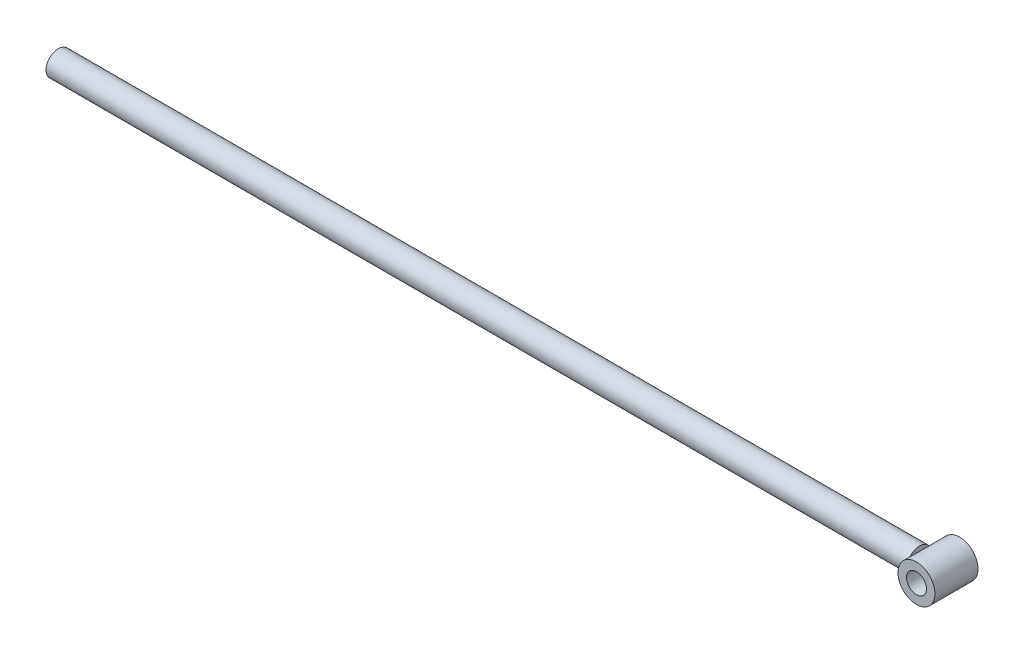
from build123d import *

# Parameters (mm, degrees)
ESQUISSE1_R      = 10
EXTRUSION1_DEPTH = 700
ESQUISSE2_R      = 15
ESQUISSE2_R_2    = 8.1
EXTRUSION2_DEPTH = 17.5


with BuildPart() as part:
    # Esquisse1 → Extrusion1 (new body)
    with BuildSketch(Plane(origin=(0, 0, 0), x_dir=(0, 0, -1), z_dir=(1, 0, 0))):
        Circle(ESQUISSE1_R)
    extrude(amount=EXTRUSION1_DEPTH)


with BuildPart() as body_2:
    # Esquisse2 → Extrusion2 (new, symmetric)
    with BuildSketch(Plane.XY):
        with Locations((715, 0)):
            Circle(ESQUISSE2_R)
        with Locations((715, 0)):
            Circle(ESQUISSE2_R_2, mode=Mode.SUBTRACT)
    extrude(amount=EXTRUSION2_DEPTH, both=True)


solid = Compound([part.part, body_2.part])
